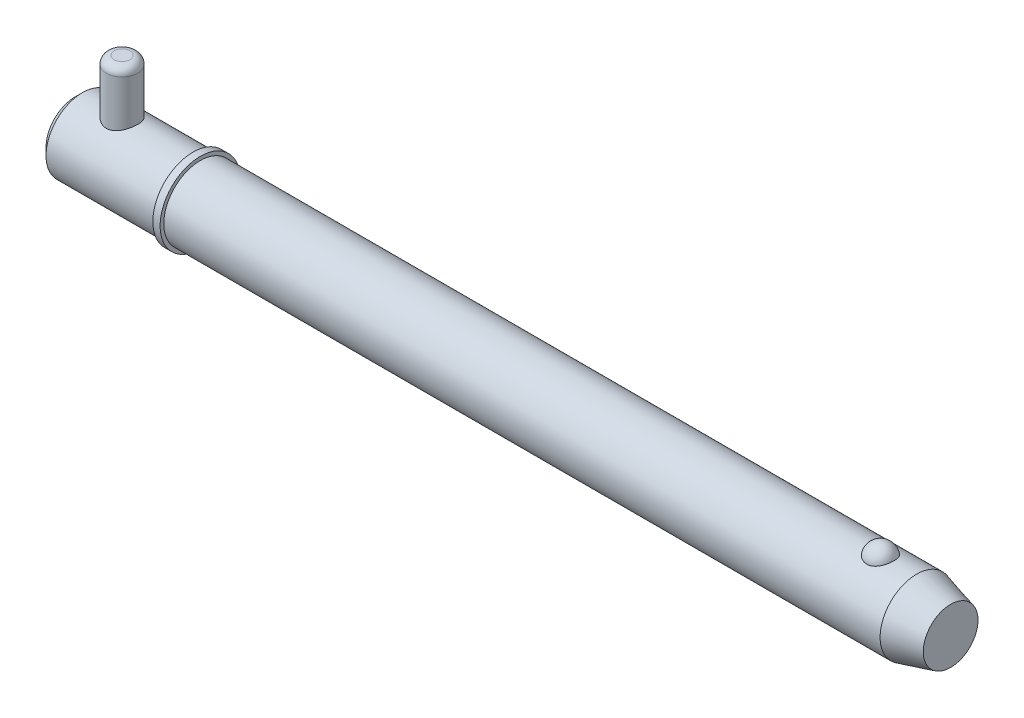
ISO-10303-21;
HEADER;
FILE_DESCRIPTION(('STEP AP214'),'2;1');
FILE_NAME('part.step','',(''),(''),'','','');
FILE_SCHEMA(('AUTOMOTIVE_DESIGN { 1 0 10303 214 1 1 1 1 }'));
ENDSEC;
DATA;
#1=APPLICATION_CONTEXT('core data for automotive mechanical design processes');
#2=APPLICATION_PROTOCOL_DEFINITION('international standard','automotive_design',2000,#1);
#3=PRODUCT_CONTEXT('',#1,'mechanical');
#4=PRODUCT('Part','Part','',(#3));
#5=PRODUCT_RELATED_PRODUCT_CATEGORY('part','',(#4));
#6=PRODUCT_DEFINITION_FORMATION('','',#4);
#7=PRODUCT_DEFINITION_CONTEXT('part definition',#1,'design');
#8=PRODUCT_DEFINITION('design','',#6,#7);
#9=PRODUCT_DEFINITION_SHAPE('','',#8);
#10=(LENGTH_UNIT() NAMED_UNIT(*) SI_UNIT(.MILLI.,.METRE.));
#11=(NAMED_UNIT(*) PLANE_ANGLE_UNIT() SI_UNIT($,.RADIAN.));
#12=(NAMED_UNIT(*) SI_UNIT($,.STERADIAN.) SOLID_ANGLE_UNIT());
#13=UNCERTAINTY_MEASURE_WITH_UNIT(LENGTH_MEASURE(1.E-05),#10,'distance_accuracy_value','');
#14=(GEOMETRIC_REPRESENTATION_CONTEXT(3) GLOBAL_UNCERTAINTY_ASSIGNED_CONTEXT((#13)) GLOBAL_UNIT_ASSIGNED_CONTEXT((#10,
#11,#12)) REPRESENTATION_CONTEXT('',''));
#15=CARTESIAN_POINT('',(0.,0.,0.));
#16=DIRECTION('',(0.,0.,1.));
#17=DIRECTION('',(1.,0.,0.));
#18=AXIS2_PLACEMENT_3D('',#15,#16,#17);
#19=CARTESIAN_POINT('',(14.28,26.985,0.));
#20=DIRECTION('',(0.,-1.,0.));
#21=DIRECTION('',(0.,0.,-1.));
#22=AXIS2_PLACEMENT_3D('',#19,#20,#21);
#23=CYLINDRICAL_SURFACE('',#22,4.76);
#24=CARTESIAN_POINT('',(14.28,-8.73500000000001,0.));
#25=DIRECTION('',(0.,1.,0.));
#26=DIRECTION('',(0.,0.,1.));
#27=AXIS2_PLACEMENT_3D('',#24,#25,#26);
#28=CIRCLE('',#27,4.76);
#29=CARTESIAN_POINT('',(14.28,-8.73500000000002,-4.76));
#30=VERTEX_POINT('',#29);
#31=EDGE_CURVE('P0_E25',#30,#30,#28,.T.);
#32=CARTESIAN_POINT('',(14.28,24.605,0.));
#33=DIRECTION('',(0.,1.,0.));
#34=DIRECTION('',(0.,0.,1.));
#35=AXIS2_PLACEMENT_3D('',#32,#33,#34);
#36=CIRCLE('',#35,4.76);
#37=CARTESIAN_POINT('',(14.28,24.605,-4.76));
#38=VERTEX_POINT('',#37);
#39=EDGE_CURVE('P0_E29',#38,#38,#36,.F.);
#40=CARTESIAN_POINT('',(14.28,-8.73500000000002,-4.76));
#41=CARTESIAN_POINT('',(14.28,-8.38770833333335,-4.76));
#42=CARTESIAN_POINT('',(14.28,-8.04041666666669,-4.76));
#43=CARTESIAN_POINT('',(14.28,-7.34583333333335,-4.76));
#44=CARTESIAN_POINT('',(14.28,-6.99854166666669,-4.76));
#45=CARTESIAN_POINT('',(14.28,-6.30395833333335,-4.76));
#46=CARTESIAN_POINT('',(14.28,-5.95666666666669,-4.76));
#47=CARTESIAN_POINT('',(14.28,-5.26208333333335,-4.76));
#48=CARTESIAN_POINT('',(14.28,-4.91479166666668,-4.76));
#49=CARTESIAN_POINT('',(14.28,-4.22020833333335,-4.76));
#50=CARTESIAN_POINT('',(14.28,-3.87291666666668,-4.76));
#51=CARTESIAN_POINT('',(14.28,-3.17833333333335,-4.76));
#52=CARTESIAN_POINT('',(14.28,-2.83104166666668,-4.76));
#53=CARTESIAN_POINT('',(14.28,-2.13645833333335,-4.76));
#54=CARTESIAN_POINT('',(14.28,-1.78916666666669,-4.76));
#55=CARTESIAN_POINT('',(14.28,-1.09458333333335,-4.76));
#56=CARTESIAN_POINT('',(14.28,-0.747291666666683,-4.76));
#57=CARTESIAN_POINT('',(14.28,-0.052708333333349,-4.76));
#58=CARTESIAN_POINT('',(14.28,0.294583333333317,-4.76));
#59=CARTESIAN_POINT('',(14.28,0.989166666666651,-4.76));
#60=CARTESIAN_POINT('',(14.28,1.33645833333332,-4.76));
#61=CARTESIAN_POINT('',(14.28,2.03104166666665,-4.76));
#62=CARTESIAN_POINT('',(14.28,2.37833333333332,-4.76));
#63=CARTESIAN_POINT('',(14.28,3.07291666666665,-4.76));
#64=CARTESIAN_POINT('',(14.28,3.42020833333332,-4.76));
#65=CARTESIAN_POINT('',(14.28,4.11479166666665,-4.76));
#66=CARTESIAN_POINT('',(14.28,4.46208333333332,-4.76));
#67=CARTESIAN_POINT('',(14.28,5.15666666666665,-4.76));
#68=CARTESIAN_POINT('',(14.28,5.50395833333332,-4.76));
#69=CARTESIAN_POINT('',(14.28,6.19854166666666,-4.76));
#70=CARTESIAN_POINT('',(14.28,6.54583333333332,-4.76));
#71=CARTESIAN_POINT('',(14.28,7.24041666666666,-4.76));
#72=CARTESIAN_POINT('',(14.28,7.58770833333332,-4.76));
#73=CARTESIAN_POINT('',(14.28,8.28229166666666,-4.76));
#74=CARTESIAN_POINT('',(14.28,8.62958333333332,-4.76));
#75=CARTESIAN_POINT('',(14.28,9.32416666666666,-4.76));
#76=CARTESIAN_POINT('',(14.28,9.67145833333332,-4.76));
#77=CARTESIAN_POINT('',(14.28,10.3660416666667,-4.76));
#78=CARTESIAN_POINT('',(14.28,10.7133333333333,-4.76));
#79=CARTESIAN_POINT('',(14.28,11.4079166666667,-4.76));
#80=CARTESIAN_POINT('',(14.28,11.7552083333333,-4.76));
#81=CARTESIAN_POINT('',(14.28,12.4497916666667,-4.76));
#82=CARTESIAN_POINT('',(14.28,12.7970833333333,-4.76));
#83=CARTESIAN_POINT('',(14.28,13.4916666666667,-4.76));
#84=CARTESIAN_POINT('',(14.28,13.8389583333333,-4.76));
#85=CARTESIAN_POINT('',(14.28,14.5335416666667,-4.76));
#86=CARTESIAN_POINT('',(14.28,14.8808333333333,-4.76));
#87=CARTESIAN_POINT('',(14.28,15.5754166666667,-4.76));
#88=CARTESIAN_POINT('',(14.28,15.9227083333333,-4.76));
#89=CARTESIAN_POINT('',(14.28,16.6172916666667,-4.76));
#90=CARTESIAN_POINT('',(14.28,16.9645833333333,-4.76));
#91=CARTESIAN_POINT('',(14.28,17.6591666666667,-4.76));
#92=CARTESIAN_POINT('',(14.28,18.0064583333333,-4.76));
#93=CARTESIAN_POINT('',(14.28,18.7010416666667,-4.76));
#94=CARTESIAN_POINT('',(14.28,19.0483333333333,-4.76));
#95=CARTESIAN_POINT('',(14.28,19.7429166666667,-4.76));
#96=CARTESIAN_POINT('',(14.28,20.0902083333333,-4.76));
#97=CARTESIAN_POINT('',(14.28,20.7847916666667,-4.76));
#98=CARTESIAN_POINT('',(14.28,21.1320833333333,-4.76));
#99=CARTESIAN_POINT('',(14.28,21.8266666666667,-4.76));
#100=CARTESIAN_POINT('',(14.28,22.1739583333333,-4.76));
#101=CARTESIAN_POINT('',(14.28,22.8685416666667,-4.76));
#102=CARTESIAN_POINT('',(14.28,23.2158333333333,-4.76));
#103=CARTESIAN_POINT('',(14.28,23.9104166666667,-4.76));
#104=CARTESIAN_POINT('',(14.28,24.2577083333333,-4.76));
#105=CARTESIAN_POINT('',(14.28,24.605,-4.76));
#106=B_SPLINE_CURVE_WITH_KNOTS('',3,(#40,#41,#42,#43,#44,#45,#46,#47,#48,#49,#50,#51,#52,#53,
#54,#55,#56,#57,#58,#59,#60,#61,#62,#63,#64,#65,#66,#67,#68,#69,#70,#71,#72,#73,#74,#75,#76,#77,
#78,#79,#80,#81,#82,#83,#84,#85,#86,#87,#88,#89,#90,#91,#92,#93,#94,#95,#96,#97,#98,#99,#100,
#101,#102,#103,#104,#105),.UNSPECIFIED.,.F.,.F.,(4,2,2,2,2,2,2,2,2,2,2,2,2,2,2,2,2,2,2,2,2,2,2,
2,2,2,2,2,2,2,2,2,4),(0.,1.041875,2.08375,3.125625,4.1675,5.209375,6.25125,7.293125,
8.33500000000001,9.376875,10.41875,11.460625,12.5025,13.544375,14.58625,15.628125,16.67,
17.711875,18.75375,19.795625,20.8375,21.879375,22.92125,23.963125,25.005,26.046875,27.08875,
28.130625,29.1725,30.214375,31.25625,32.298125,33.34),.UNSPECIFIED.);
#107=EDGE_CURVE('P0_BSEAM14',#30,#38,#106,.T.);
#108=ORIENTED_EDGE('',*,*,#31,.T.);
#109=ORIENTED_EDGE('',*,*,#39,.T.);
#110=ORIENTED_EDGE('',*,*,#107,.T.);
#111=ORIENTED_EDGE('',*,*,#107,.F.);
#112=EDGE_LOOP('',(#108,#110,#109,#111));
#113=FACE_BOUND('',#112,.T.);
#114=ADVANCED_FACE('P0_F14',(#113),#23,.T.);
#115=CARTESIAN_POINT('',(14.28,26.985,0.));
#116=DIRECTION('',(0.,1.,0.));
#117=DIRECTION('',(0.,0.,1.));
#118=AXIS2_PLACEMENT_3D('',#115,#116,#117);
#119=PLANE('',#118);
#120=CARTESIAN_POINT('',(14.28,26.985,0.));
#121=DIRECTION('',(0.,1.,0.));
#122=DIRECTION('',(0.,0.,1.));
#123=AXIS2_PLACEMENT_3D('',#120,#121,#122);
#124=CIRCLE('',#123,2.38);
#125=CARTESIAN_POINT('',(14.28,26.985,2.38));
#126=VERTEX_POINT('',#125);
#127=EDGE_CURVE('P0_E10',#126,#126,#124,.T.);
#128=ORIENTED_EDGE('',*,*,#127,.T.);
#129=EDGE_LOOP('',(#128));
#130=FACE_BOUND('',#129,.T.);
#131=ADVANCED_FACE('P0_F46',(#130),#119,.T.);
#132=CARTESIAN_POINT('',(14.28,-11.115,0.));
#133=DIRECTION('',(0.,1.,0.));
#134=DIRECTION('',(0.,0.,1.));
#135=AXIS2_PLACEMENT_3D('',#132,#133,#134);
#136=PLANE('',#135);
#137=CARTESIAN_POINT('',(14.28,-11.115,0.));
#138=DIRECTION('',(0.,1.,0.));
#139=DIRECTION('',(0.,0.,1.));
#140=AXIS2_PLACEMENT_3D('',#137,#138,#139);
#141=CIRCLE('',#140,2.38);
#142=CARTESIAN_POINT('',(14.28,-11.115,2.38));
#143=VERTEX_POINT('',#142);
#144=EDGE_CURVE('P0_E21',#143,#143,#141,.F.);
#145=ORIENTED_EDGE('',*,*,#144,.T.);
#146=EDGE_LOOP('',(#145));
#147=FACE_BOUND('',#146,.T.);
#148=ADVANCED_FACE('P0_F43',(#147),#136,.F.);
#149=CARTESIAN_POINT('',(14.28,-8.735,0.));
#150=DIRECTION('',(0.,1.,0.));
#151=DIRECTION('',(0.,0.,1.));
#152=AXIS2_PLACEMENT_3D('',#149,#150,#151);
#153=DEGENERATE_TOROIDAL_SURFACE('',#152,2.38,2.38,.T.);
#154=ORIENTED_EDGE('',*,*,#144,.F.);
#155=EDGE_LOOP('',(#154));
#156=FACE_BOUND('',#155,.T.);
#157=ORIENTED_EDGE('',*,*,#31,.F.);
#158=EDGE_LOOP('',(#157));
#159=FACE_BOUND('',#158,.T.);
#160=ADVANCED_FACE('P0_F38',(#156,#159),#153,.T.);
#161=CARTESIAN_POINT('',(14.28,24.605,0.));
#162=DIRECTION('',(0.,1.,0.));
#163=DIRECTION('',(0.,0.,1.));
#164=AXIS2_PLACEMENT_3D('',#161,#162,#163);
#165=DEGENERATE_TOROIDAL_SURFACE('',#164,2.38,2.38,.T.);
#166=ORIENTED_EDGE('',*,*,#39,.F.);
#167=EDGE_LOOP('',(#166));
#168=FACE_BOUND('',#167,.T.);
#169=ORIENTED_EDGE('',*,*,#127,.F.);
#170=EDGE_LOOP('',(#169));
#171=FACE_BOUND('',#170,.T.);
#172=ADVANCED_FACE('P0_F16',(#168,#171),#165,.T.);
#173=CLOSED_SHELL('',(#114,#131,#148,#160,#172));
#174=MANIFOLD_SOLID_BREP('P0_B1',#173);
#175=CARTESIAN_POINT('',(0.,0.,0.));
#176=DIRECTION('',(1.,0.,0.));
#177=DIRECTION('',(0.,0.,-1.));
#178=AXIS2_PLACEMENT_3D('',#175,#176,#177);
#179=CYLINDRICAL_SURFACE('',#178,11.115);
#180=CARTESIAN_POINT('',(256.329563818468,0.,0.));
#181=DIRECTION('',(1.,0.,0.));
#182=DIRECTION('',(0.,0.,-1.));
#183=AXIS2_PLACEMENT_3D('',#180,#181,#182);
#184=CIRCLE('',#183,11.115);
#185=CARTESIAN_POINT('',(256.329563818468,0.,-11.115));
#186=VERTEX_POINT('',#185);
#187=EDGE_CURVE('P1_E81',#186,#186,#184,.T.);
#188=ORIENTED_EDGE('',*,*,#187,.F.);
#189=EDGE_LOOP('',(#188));
#190=FACE_BOUND('',#189,.T.);
#191=CARTESIAN_POINT('',(38.1,0.,0.));
#192=DIRECTION('',(1.,0.,0.));
#193=DIRECTION('',(0.,0.,-1.));
#194=AXIS2_PLACEMENT_3D('',#191,#192,#193);
#195=CIRCLE('',#194,11.115);
#196=CARTESIAN_POINT('',(38.1,0.,-11.115));
#197=VERTEX_POINT('',#196);
#198=EDGE_CURVE('P1_E85',#197,#197,#195,.T.);
#199=ORIENTED_EDGE('',*,*,#198,.T.);
#200=EDGE_LOOP('',(#199));
#201=FACE_BOUND('',#200,.T.);
#202=CARTESIAN_POINT('',(245.331068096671,10.3028087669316,4.17077409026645));
#203=CARTESIAN_POINT('',(245.114775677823,10.3028003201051,4.17078240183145));
#204=CARTESIAN_POINT('',(244.898548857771,10.3098895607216,4.15340593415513));
#205=CARTESIAN_POINT('',(244.472540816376,10.3373834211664,4.08449540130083));
#206=CARTESIAN_POINT('',(244.262757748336,10.3577841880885,4.0329712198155));
#207=CARTESIAN_POINT('',(243.855782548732,10.4095237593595,3.89746513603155));
#208=CARTESIAN_POINT('',(243.658572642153,10.4408466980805,3.81353029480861));
#209=CARTESIAN_POINT('',(243.281338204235,10.5110236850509,3.61560339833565));
#210=CARTESIAN_POINT('',(243.101317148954,10.5498792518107,3.50160528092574));
#211=CARTESIAN_POINT('',(242.757684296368,10.6322884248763,3.24292464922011));
#212=CARTESIAN_POINT('',(242.594686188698,10.6759443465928,3.09746040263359));
#213=CARTESIAN_POINT('',(242.294591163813,10.7625291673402,2.7817192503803));
#214=CARTESIAN_POINT('',(242.157499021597,10.8054579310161,2.61143778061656));
#215=CARTESIAN_POINT('',(241.906408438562,10.8881935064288,2.24226695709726));
#216=CARTESIAN_POINT('',(241.793710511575,10.9277761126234,2.04244123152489));
#217=CARTESIAN_POINT('',(241.601777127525,10.997484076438,1.62578254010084));
#218=CARTESIAN_POINT('',(241.522544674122,11.0276085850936,1.40894804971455));
#219=CARTESIAN_POINT('',(241.398303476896,11.0756732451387,0.961250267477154));
#220=CARTESIAN_POINT('',(241.353760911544,11.0934470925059,0.730239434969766));
#221=CARTESIAN_POINT('',(241.301569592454,11.1143331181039,0.263439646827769));
#222=CARTESIAN_POINT('',(241.293920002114,11.1174456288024,0.027650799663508));
#223=CARTESIAN_POINT('',(241.31561056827,11.1087161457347,-0.440729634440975));
#224=CARTESIAN_POINT('',(241.344762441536,11.0969502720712,-0.673331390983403));
#225=CARTESIAN_POINT('',(241.439143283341,11.0597872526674,-1.12996621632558));
#226=CARTESIAN_POINT('',(241.504372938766,11.0343898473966,-1.35399912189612));
#227=CARTESIAN_POINT('',(241.66969844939,10.972515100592,-1.78750286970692));
#228=CARTESIAN_POINT('',(241.76983863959,10.9360236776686,-1.99695478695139));
#229=CARTESIAN_POINT('',(242.002940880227,10.8557595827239,-2.3952066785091));
#230=CARTESIAN_POINT('',(242.135905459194,10.8119863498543,-2.5840050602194));
#231=CARTESIAN_POINT('',(242.432407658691,10.7216733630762,-2.93635726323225));
#232=CARTESIAN_POINT('',(242.596056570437,10.675123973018,-3.09981510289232));
#233=CARTESIAN_POINT('',(242.949860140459,10.5846571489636,-3.39592247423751));
#234=CARTESIAN_POINT('',(243.140012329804,10.5407394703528,-3.52857487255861));
#235=CARTESIAN_POINT('',(243.53750141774,10.4616690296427,-3.75646057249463));
#236=CARTESIAN_POINT('',(243.74436705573,10.4263443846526,-3.85245432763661));
#237=CARTESIAN_POINT('',(244.172954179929,10.3675574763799,-4.00798747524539));
#238=CARTESIAN_POINT('',(244.394670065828,10.344090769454,-4.0675405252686));
#239=CARTESIAN_POINT('',(244.834669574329,10.3128282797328,-4.14614314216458));
#240=CARTESIAN_POINT('',(245.052565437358,10.3043040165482,-4.1670783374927));
#241=CARTESIAN_POINT('',(245.48894951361,10.3016771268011,-4.17357158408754));
#242=CARTESIAN_POINT('',(245.707437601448,10.3075716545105,-4.15913661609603));
#243=CARTESIAN_POINT('',(246.131744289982,10.3326686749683,-4.09636961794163));
#244=CARTESIAN_POINT('',(246.337745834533,10.3514555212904,-4.0490957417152));
#245=CARTESIAN_POINT('',(246.738576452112,10.399818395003,-3.92320197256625));
#246=CARTESIAN_POINT('',(246.9334046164,10.4293952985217,-3.84457953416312));
#247=CARTESIAN_POINT('',(247.311191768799,10.4969600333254,-3.65612410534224));
#248=CARTESIAN_POINT('',(247.493797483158,10.5351178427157,-3.54564545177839));
#249=CARTESIAN_POINT('',(247.838204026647,10.6154999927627,-3.29718036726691));
#250=CARTESIAN_POINT('',(248.000000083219,10.657725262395,-3.15918764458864));
#251=CARTESIAN_POINT('',(248.306959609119,10.744212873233,-2.85163580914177));
#252=CARTESIAN_POINT('',(248.450891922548,10.7884718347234,-2.68084605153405));
#253=CARTESIAN_POINT('',(248.709237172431,10.872374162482,-2.31721864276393));
#254=CARTESIAN_POINT('',(248.823644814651,10.9120167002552,-2.12437704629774));
#255=CARTESIAN_POINT('',(249.023873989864,10.9838919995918,-1.71516999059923));
#256=CARTESIAN_POINT('',(249.10866178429,11.0158465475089,-1.49824866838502));
#257=CARTESIAN_POINT('',(249.24268382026,11.0673523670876,-1.05228572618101));
#258=CARTESIAN_POINT('',(249.291917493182,11.086903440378,-0.823243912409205));
#259=CARTESIAN_POINT('',(249.353891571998,11.1116323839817,-0.359087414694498));
#260=CARTESIAN_POINT('',(249.366566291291,11.1167843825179,-0.123962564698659));
#261=CARTESIAN_POINT('',(249.354973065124,11.1121144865,0.345220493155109));
#262=CARTESIAN_POINT('',(249.330705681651,11.1022928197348,0.579278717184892));
#263=CARTESIAN_POINT('',(249.245907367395,11.0687504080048,1.03866534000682));
#264=CARTESIAN_POINT('',(249.185529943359,11.0450885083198,1.26402641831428));
#265=CARTESIAN_POINT('',(249.029853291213,10.9863185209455,1.70076772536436));
#266=CARTESIAN_POINT('',(248.934551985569,10.9512097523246,1.91214712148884));
#267=CARTESIAN_POINT('',(248.710397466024,10.8729733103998,2.316083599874));
#268=CARTESIAN_POINT('',(248.581380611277,10.8298068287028,2.50854240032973));
#269=CARTESIAN_POINT('',(248.292732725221,10.7401896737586,2.86808766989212));
#270=CARTESIAN_POINT('',(248.133102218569,10.6937390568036,3.03517457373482));
#271=CARTESIAN_POINT('',(247.787534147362,10.6029321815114,3.33857581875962));
#272=CARTESIAN_POINT('',(247.601708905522,10.5585680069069,3.47501541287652));
#273=CARTESIAN_POINT('',(247.207875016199,10.4769321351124,3.71390897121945));
#274=CARTESIAN_POINT('',(246.999863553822,10.439661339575,3.81635861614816));
#275=CARTESIAN_POINT('',(246.554066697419,10.3749407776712,3.98910631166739));
#276=CARTESIAN_POINT('',(246.315234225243,10.3482457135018,4.05700929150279));
#277=CARTESIAN_POINT('',(245.827925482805,10.312188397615,4.14782844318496));
#278=CARTESIAN_POINT('',(245.579453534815,10.3028184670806,4.17076454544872));
#279=CARTESIAN_POINT('',(245.331068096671,10.3028087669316,4.17077409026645));
#280=B_SPLINE_CURVE_WITH_KNOTS('',3,(#202,#203,#204,#205,#206,#207,#208,#209,#210,#211,#212,
#213,#214,#215,#216,#217,#218,#219,#220,#221,#222,#223,#224,#225,#226,#227,#228,#229,#230,#231,
#232,#233,#234,#235,#236,#237,#238,#239,#240,#241,#242,#243,#244,#245,#246,#247,#248,#249,#250,
#251,#252,#253,#254,#255,#256,#257,#258,#259,#260,#261,#262,#263,#264,#265,#266,#267,#268,#269,
#270,#271,#272,#273,#274,#275,#276,#277,#278,#279),.UNSPECIFIED.,.T.,.F.,(4,2,2,2,2,2,2,2,2,2,2,
2,2,2,2,2,2,2,2,2,2,2,2,2,2,2,2,2,2,2,2,2,2,2,2,2,2,2,4),(0.,0.64796614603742,1.29574482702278,
1.94258643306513,2.58955857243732,3.25496465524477,3.92049326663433,4.61566368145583,
5.31089647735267,6.01531821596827,6.71972398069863,7.42054043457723,8.12137023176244,
8.82309331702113,9.5248704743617,10.2292439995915,10.9335519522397,11.6223330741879,
12.3108558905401,12.9647664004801,13.6185478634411,14.252184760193,14.8858731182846,
15.5334360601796,16.1811472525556,16.8611459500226,17.5412664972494,18.2431855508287,
18.9451158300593,19.6483065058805,20.3514864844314,21.0516982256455,21.7519516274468,
22.4556690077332,23.1593743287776,23.860149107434,24.5610129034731,25.3054529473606,
26.049562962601),.UNSPECIFIED.);
#281=CARTESIAN_POINT('',(245.331068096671,10.3028087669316,4.17077409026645));
#282=VERTEX_POINT('',#281);
#283=EDGE_CURVE('P1_E35',#282,#282,#280,.T.);
#284=ORIENTED_EDGE('',*,*,#283,.T.);
#285=EDGE_LOOP('',(#284));
#286=FACE_BOUND('',#285,.T.);
#287=ADVANCED_FACE('P1_F13',(#190,#201,#286),#179,.T.);
#288=CARTESIAN_POINT('',(0.,0.,0.));
#289=DIRECTION('',(-1.,0.,0.));
#290=DIRECTION('',(0.,0.,1.));
#291=AXIS2_PLACEMENT_3D('',#288,#289,#290);
#292=PLANE('',#291);
#293=CARTESIAN_POINT('',(0.,0.,0.));
#294=DIRECTION('',(1.,0.,0.));
#295=DIRECTION('',(0.,0.,-1.));
#296=AXIS2_PLACEMENT_3D('',#293,#294,#295);
#297=CIRCLE('',#296,8.892);
#298=CARTESIAN_POINT('',(0.,0.,-8.892));
#299=VERTEX_POINT('',#298);
#300=EDGE_CURVE('P1_E9',#299,#299,#297,.T.);
#301=ORIENTED_EDGE('',*,*,#300,.F.);
#302=EDGE_LOOP('',(#301));
#303=FACE_BOUND('',#302,.T.);
#304=ADVANCED_FACE('P1_F15',(#303),#292,.T.);
#305=CARTESIAN_POINT('',(2.22299999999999,0.,0.));
#306=DIRECTION('',(1.,0.,0.));
#307=DIRECTION('',(0.,0.,-1.));
#308=AXIS2_PLACEMENT_3D('',#305,#306,#307);
#309=CONICAL_SURFACE('',#308,11.115,0.78539816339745);
#310=ORIENTED_EDGE('',*,*,#300,.T.);
#311=EDGE_LOOP('',(#310));
#312=FACE_BOUND('',#311,.T.);
#313=CARTESIAN_POINT('',(2.22299999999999,0.,0.));
#314=DIRECTION('',(1.,0.,0.));
#315=DIRECTION('',(0.,0.,-1.));
#316=AXIS2_PLACEMENT_3D('',#313,#314,#315);
#317=CIRCLE('',#316,11.115);
#318=CARTESIAN_POINT('',(2.22299999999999,0.,-11.115));
#319=VERTEX_POINT('',#318);
#320=EDGE_CURVE('P1_E26',#319,#319,#317,.T.);
#321=ORIENTED_EDGE('',*,*,#320,.F.);
#322=EDGE_LOOP('',(#321));
#323=FACE_BOUND('',#322,.T.);
#324=ADVANCED_FACE('P1_F77',(#312,#323),#309,.T.);
#325=CARTESIAN_POINT('',(0.,0.,0.));
#326=DIRECTION('',(1.,0.,0.));
#327=DIRECTION('',(0.,0.,-1.));
#328=AXIS2_PLACEMENT_3D('',#325,#326,#327);
#329=CYLINDRICAL_SURFACE('',#328,11.115);
#330=CARTESIAN_POINT('',(14.28,-10.0441836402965,4.76));
#331=CARTESIAN_POINT('',(14.1533731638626,-10.0441846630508,4.75999904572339));
#332=CARTESIAN_POINT('',(14.0267055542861,-10.0465865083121,4.75493985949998));
#333=CARTESIAN_POINT('',(13.774298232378,-10.0561141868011,4.73475585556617));
#334=CARTESIAN_POINT('',(13.6485591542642,-10.0632429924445,4.71962470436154));
#335=CARTESIAN_POINT('',(13.3987500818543,-10.0819979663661,4.67942666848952));
#336=CARTESIAN_POINT('',(13.2746840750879,-10.0936334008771,4.65433930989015));
#337=CARTESIAN_POINT('',(13.0293244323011,-10.1210146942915,4.59449317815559));
#338=CARTESIAN_POINT('',(12.9080319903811,-10.1367622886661,4.55973032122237));
#339=CARTESIAN_POINT('',(12.669614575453,-10.1717810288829,4.48106435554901));
#340=CARTESIAN_POINT('',(12.5524727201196,-10.1910352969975,4.4372048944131));
#341=CARTESIAN_POINT('',(12.3224300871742,-10.2325403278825,4.34063417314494));
#342=CARTESIAN_POINT('',(12.2095309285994,-10.2547922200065,4.28791957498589));
#343=CARTESIAN_POINT('',(11.8782785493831,-10.3250879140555,4.11715127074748));
#344=CARTESIAN_POINT('',(11.6670799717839,-10.3767168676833,3.98637638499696));
#345=CARTESIAN_POINT('',(11.2564039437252,-10.4874309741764,3.68567149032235));
#346=CARTESIAN_POINT('',(11.0583793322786,-10.5467772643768,3.51386978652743));
#347=CARTESIAN_POINT('',(10.6927724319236,-10.6641377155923,3.13969960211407));
#348=CARTESIAN_POINT('',(10.5252022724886,-10.7221513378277,2.93731900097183));
#349=CARTESIAN_POINT('',(10.2965609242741,-10.8050020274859,2.60935726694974));
#350=CARTESIAN_POINT('',(10.2227768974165,-10.8324811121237,2.49310321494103));
#351=CARTESIAN_POINT('',(10.0853380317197,-10.884703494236,2.25418999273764));
#352=CARTESIAN_POINT('',(10.0216789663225,-10.9094479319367,2.13153352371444));
#353=CARTESIAN_POINT('',(9.90506238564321,-10.9554932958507,1.88060370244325));
#354=CARTESIAN_POINT('',(9.85210574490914,-10.9767939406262,1.7523298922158));
#355=CARTESIAN_POINT('',(9.75746464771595,-11.0153112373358,1.49115740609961));
#356=CARTESIAN_POINT('',(9.71577447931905,-11.0325299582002,1.35826111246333));
#357=CARTESIAN_POINT('',(9.64605475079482,-11.0615607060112,1.09614539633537));
#358=CARTESIAN_POINT('',(9.61740732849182,-11.0736151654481,0.96711700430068));
#359=CARTESIAN_POINT('',(9.57092026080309,-11.0932687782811,0.706847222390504));
#360=CARTESIAN_POINT('',(9.55307574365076,-11.1008699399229,0.575606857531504));
#361=CARTESIAN_POINT('',(9.52838640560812,-11.1114054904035,0.31192917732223));
#362=CARTESIAN_POINT('',(9.52153986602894,-11.114340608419,0.179492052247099));
#363=CARTESIAN_POINT('',(9.51892405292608,-11.1154607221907,-0.0855090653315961));
#364=CARTESIAN_POINT('',(9.52315432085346,-11.1136459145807,-0.218073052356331));
#365=CARTESIAN_POINT('',(9.542009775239,-11.1055891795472,-0.473709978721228));
#366=CARTESIAN_POINT('',(9.55594693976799,-11.099640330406,-0.596843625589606));
#367=CARTESIAN_POINT('',(9.59332832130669,-11.0837823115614,-0.841440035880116));
#368=CARTESIAN_POINT('',(9.61677567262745,-11.0738718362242,-0.962902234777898));
#369=CARTESIAN_POINT('',(9.67294089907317,-11.0503378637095,-1.20325684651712));
#370=CARTESIAN_POINT('',(9.70565569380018,-11.0367156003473,-1.32215009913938));
#371=CARTESIAN_POINT('',(9.78005008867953,-11.0060908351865,-1.55666640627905));
#372=CARTESIAN_POINT('',(9.82173311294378,-10.9890870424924,-1.67228819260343));
#373=CARTESIAN_POINT('',(9.96110379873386,-10.9330280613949,-2.01656166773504));
#374=CARTESIAN_POINT('',(10.0722987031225,-10.8892801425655,-2.23915547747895));
#375=CARTESIAN_POINT('',(10.3268588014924,-10.7934745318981,-2.66299199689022));
#376=CARTESIAN_POINT('',(10.4702355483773,-10.7414138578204,-2.86422700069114));
#377=CARTESIAN_POINT('',(10.7973904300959,-10.6296201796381,-3.25557775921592));
#378=CARTESIAN_POINT('',(10.9833705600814,-10.569604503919,-3.443774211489));
#379=CARTESIAN_POINT('',(11.3844486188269,-10.4514707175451,-3.78722133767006));
#380=CARTESIAN_POINT('',(11.5995590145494,-10.3933534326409,-3.94245783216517));
#381=CARTESIAN_POINT('',(11.9444340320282,-10.311516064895,-4.14990014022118));
#382=CARTESIAN_POINT('',(12.0654579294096,-10.2847012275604,-4.21573894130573));
#383=CARTESIAN_POINT('',(12.3132718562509,-10.2342051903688,-4.33688518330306));
#384=CARTESIAN_POINT('',(12.4400593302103,-10.2105226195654,-4.39219723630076));
#385=CARTESIAN_POINT('',(12.6985418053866,-10.1671237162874,-4.49174500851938));
#386=CARTESIAN_POINT('',(12.8302359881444,-10.1474067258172,-4.53598256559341));
#387=CARTESIAN_POINT('',(13.0975061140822,-10.1126841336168,-4.61287629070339));
#388=CARTESIAN_POINT('',(13.233079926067,-10.0976759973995,-4.64553869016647));
#389=CARTESIAN_POINT('',(13.4978553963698,-10.0737863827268,-4.6971059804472));
#390=CARTESIAN_POINT('',(13.6268754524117,-10.0645618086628,-4.716785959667));
#391=CARTESIAN_POINT('',(13.8862990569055,-10.051062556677,-4.74548419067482));
#392=CARTESIAN_POINT('',(14.0167019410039,-10.0467856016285,-4.75450734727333));
#393=CARTESIAN_POINT('',(14.277859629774,-10.0433352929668,-4.76179143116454));
#394=CARTESIAN_POINT('',(14.4086143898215,-10.0441613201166,-4.76005366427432));
#395=CARTESIAN_POINT('',(14.6694025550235,-10.0508838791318,-4.74584231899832));
#396=CARTESIAN_POINT('',(14.7994359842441,-10.0567802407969,-4.73336910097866));
#397=CARTESIAN_POINT('',(15.0487369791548,-10.0728449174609,-4.69907984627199));
#398=CARTESIAN_POINT('',(15.1681238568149,-10.0826872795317,-4.67797462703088));
#399=CARTESIAN_POINT('',(15.4045894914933,-10.1062580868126,-4.62682977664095));
#400=CARTESIAN_POINT('',(15.5216674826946,-10.1199877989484,-4.59678723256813));
#401=CARTESIAN_POINT('',(15.868278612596,-10.1664161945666,-4.49365911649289));
#402=CARTESIAN_POINT('',(16.0933756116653,-10.2043671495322,-4.40754694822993));
#403=CARTESIAN_POINT('',(16.5357981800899,-10.2919879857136,-4.19898201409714));
#404=CARTESIAN_POINT('',(16.7523611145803,-10.3420954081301,-4.07511281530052));
#405=CARTESIAN_POINT('',(17.1627188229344,-10.4477911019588,-3.7959429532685));
#406=CARTESIAN_POINT('',(17.3565033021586,-10.5033818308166,-3.64062816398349));
#407=CARTESIAN_POINT('',(17.7334034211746,-10.6196376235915,-3.28693729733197));
#408=CARTESIAN_POINT('',(17.9141276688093,-10.6803237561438,-3.08599175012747));
#409=CARTESIAN_POINT('',(18.1582189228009,-10.7666348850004,-2.76320365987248));
#410=CARTESIAN_POINT('',(18.2351223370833,-10.7946346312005,-2.65197124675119));
#411=CARTESIAN_POINT('',(18.3793967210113,-10.8483267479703,-2.42297927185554));
#412=CARTESIAN_POINT('',(18.4467718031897,-10.87402011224,-2.30522255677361));
#413=CARTESIAN_POINT('',(18.5717669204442,-10.9225249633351,-2.06324665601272));
#414=CARTESIAN_POINT('',(18.6293326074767,-10.9453202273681,-1.93899615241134));
#415=CARTESIAN_POINT('',(18.73370006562,-10.9872100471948,-1.6855059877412));
#416=CARTESIAN_POINT('',(18.7805065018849,-11.0063062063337,-1.55626851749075));
#417=CARTESIAN_POINT('',(18.8628731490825,-11.0402419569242,-1.29375150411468));
#418=CARTESIAN_POINT('',(18.8984366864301,-11.0550828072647,-1.16047316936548));
#419=CARTESIAN_POINT('',(18.9579183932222,-11.0800638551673,-0.890912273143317));
#420=CARTESIAN_POINT('',(18.9818374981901,-11.0902044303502,-0.75462995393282));
#421=CARTESIAN_POINT('',(19.0164177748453,-11.104911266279,-0.490295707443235));
#422=CARTESIAN_POINT('',(19.027922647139,-11.1098318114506,-0.362373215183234));
#423=CARTESIAN_POINT('',(19.040554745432,-11.1152360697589,-0.105876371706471));
#424=CARTESIAN_POINT('',(19.0416784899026,-11.1157182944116,0.0226981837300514));
#425=CARTESIAN_POINT('',(19.0335275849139,-11.1122291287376,0.27938352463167));
#426=CARTESIAN_POINT('',(19.0242587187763,-11.1082602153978,0.407494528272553));
#427=CARTESIAN_POINT('',(18.9954320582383,-11.0959792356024,0.662388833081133));
#428=CARTESIAN_POINT('',(18.9758704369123,-11.0876655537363,0.789171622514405));
#429=CARTESIAN_POINT('',(18.9276379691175,-11.0673259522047,1.03545890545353));
#430=CARTESIAN_POINT('',(18.8993573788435,-11.0554596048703,1.15505309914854));
#431=CARTESIAN_POINT('',(18.8337694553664,-11.0282166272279,1.39134516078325));
#432=CARTESIAN_POINT('',(18.7964589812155,-11.0128387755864,1.5080420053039));
#433=CARTESIAN_POINT('',(18.671464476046,-10.9619666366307,1.85262797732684));
#434=CARTESIAN_POINT('',(18.5706772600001,-10.9217161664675,2.07521484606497));
#435=CARTESIAN_POINT('',(18.33202463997,-10.8301378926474,2.51061719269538));
#436=CARTESIAN_POINT('',(18.1926775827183,-10.7783885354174,2.72252375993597));
#437=CARTESIAN_POINT('',(17.8829747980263,-10.669863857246,3.12088015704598));
#438=CARTESIAN_POINT('',(17.7126068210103,-10.6130865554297,3.30731987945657));
#439=CARTESIAN_POINT('',(17.3310036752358,-10.495668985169,3.66358491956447));
#440=CARTESIAN_POINT('',(17.1177010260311,-10.4350471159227,3.83122543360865));
#441=CARTESIAN_POINT('',(16.7778915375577,-10.3495418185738,4.05420569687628));
#442=CARTESIAN_POINT('',(16.6612023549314,-10.3219229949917,4.12383380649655));
#443=CARTESIAN_POINT('',(16.4218466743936,-10.2693487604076,4.25306463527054));
#444=CARTESIAN_POINT('',(16.2991829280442,-10.2443921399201,4.31267191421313));
#445=CARTESIAN_POINT('',(16.0488008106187,-10.1979981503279,4.42126071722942));
#446=CARTESIAN_POINT('',(15.9210894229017,-10.1765561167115,4.47025635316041));
#447=CARTESIAN_POINT('',(15.6613937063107,-10.1379191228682,4.55720152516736));
#448=CARTESIAN_POINT('',(15.5294115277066,-10.1207220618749,4.59515652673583));
#449=CARTESIAN_POINT('',(15.2624981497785,-10.091252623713,4.65951684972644));
#450=CARTESIAN_POINT('',(15.1275757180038,-10.0789672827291,4.68595259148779));
#451=CARTESIAN_POINT('',(14.8556442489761,-10.0597530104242,4.72706206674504));
#452=CARTESIAN_POINT('',(14.7186368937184,-10.0528199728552,4.74174481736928));
#453=CARTESIAN_POINT('',(14.5310955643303,-10.047196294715,4.75363843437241));
#454=CARTESIAN_POINT('',(14.48091543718,-10.0460674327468,4.75602323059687));
#455=CARTESIAN_POINT('',(14.3804923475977,-10.044560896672,4.7592042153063));
#456=CARTESIAN_POINT('',(14.3302493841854,-10.0441832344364,4.76000037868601));
#457=CARTESIAN_POINT('',(14.28,-10.0441836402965,4.76));
#458=B_SPLINE_CURVE_WITH_KNOTS('',3,(#330,#331,#332,#333,#334,#335,#336,#337,#338,#339,#340,
#341,#342,#343,#344,#345,#346,#347,#348,#349,#350,#351,#352,#353,#354,#355,#356,#357,#358,#359,
#360,#361,#362,#363,#364,#365,#366,#367,#368,#369,#370,#371,#372,#373,#374,#375,#376,#377,#378,
#379,#380,#381,#382,#383,#384,#385,#386,#387,#388,#389,#390,#391,#392,#393,#394,#395,#396,#397,
#398,#399,#400,#401,#402,#403,#404,#405,#406,#407,#408,#409,#410,#411,#412,#413,#414,#415,#416,
#417,#418,#419,#420,#421,#422,#423,#424,#425,#426,#427,#428,#429,#430,#431,#432,#433,#434,#435,
#436,#437,#438,#439,#440,#441,#442,#443,#444,#445,#446,#447,#448,#449,#450,#451,#452,#453,#454,
#455,#456,#457),.UNSPECIFIED.,.T.,.F.,(4,2,2,2,2,2,2,2,2,2,2,2,2,2,2,2,2,2,2,2,2,2,2,2,2,2,2,2,
2,2,2,2,2,2,2,2,2,2,2,2,2,2,2,2,2,2,2,2,2,2,2,2,2,2,2,2,2,2,2,2,2,2,2,4),(0.,0.379828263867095,
0.759895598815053,1.14074858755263,1.52176256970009,1.90098898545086,2.28035867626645,
3.03818035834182,3.84125131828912,4.6446414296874,5.06541657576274,5.48601561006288,
5.90664899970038,6.3270687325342,6.72470503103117,7.12216187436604,7.51955659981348,
7.91693487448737,8.28868404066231,8.66055582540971,9.03230414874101,9.40419465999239,
10.1585834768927,10.9132435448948,11.7236471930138,12.5343987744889,12.9550196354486,
13.3754557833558,13.7958221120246,14.2159617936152,14.6079540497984,14.9997658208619,
15.3915300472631,15.7832811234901,16.1477615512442,16.512360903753,17.240999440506,
18.0012974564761,18.761937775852,19.5886929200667,20.0025782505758,20.4162843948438,
20.832212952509,21.2479608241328,21.6635855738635,22.0791769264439,22.4642880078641,
22.8495282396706,23.2345541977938,23.6197234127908,23.9896813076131,24.3597680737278,
25.099327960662,25.8726239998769,26.6462260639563,27.4759193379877,27.8914891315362,
28.3068693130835,28.7216936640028,29.1363123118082,29.5498292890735,29.9630287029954,
30.113753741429,30.2644811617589),.UNSPECIFIED.);
#459=CARTESIAN_POINT('',(14.28,-10.0441836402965,4.76));
#460=VERTEX_POINT('',#459);
#461=EDGE_CURVE('P1_E17',#460,#460,#458,.T.);
#462=ORIENTED_EDGE('',*,*,#461,.F.);
#463=EDGE_LOOP('',(#462));
#464=FACE_BOUND('',#463,.T.);
#465=CARTESIAN_POINT('',(14.28,10.0441836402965,4.76));
#466=CARTESIAN_POINT('',(14.4066268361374,10.0441846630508,4.75999904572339));
#467=CARTESIAN_POINT('',(14.5332944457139,10.0465865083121,4.75493985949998));
#468=CARTESIAN_POINT('',(14.785701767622,10.0561141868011,4.73475585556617));
#469=CARTESIAN_POINT('',(14.9114408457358,10.0632429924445,4.71962470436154));
#470=CARTESIAN_POINT('',(15.1612499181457,10.0819979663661,4.67942666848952));
#471=CARTESIAN_POINT('',(15.2853159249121,10.0936334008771,4.65433930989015));
#472=CARTESIAN_POINT('',(15.5306755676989,10.1210146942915,4.59449317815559));
#473=CARTESIAN_POINT('',(15.6519680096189,10.1367622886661,4.55973032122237));
#474=CARTESIAN_POINT('',(15.890385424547,10.1717810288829,4.48106435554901));
#475=CARTESIAN_POINT('',(16.0075272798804,10.1910352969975,4.4372048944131));
#476=CARTESIAN_POINT('',(16.2375699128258,10.2325403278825,4.34063417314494));
#477=CARTESIAN_POINT('',(16.3504690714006,10.2547922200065,4.28791957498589));
#478=CARTESIAN_POINT('',(16.6817214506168,10.3250879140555,4.11715127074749));
#479=CARTESIAN_POINT('',(16.8929200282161,10.3767168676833,3.98637638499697));
#480=CARTESIAN_POINT('',(17.3035960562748,10.4874309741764,3.68567149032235));
#481=CARTESIAN_POINT('',(17.5016206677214,10.5467772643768,3.51386978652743));
#482=CARTESIAN_POINT('',(17.8672275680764,10.6641377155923,3.13969960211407));
#483=CARTESIAN_POINT('',(18.0347977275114,10.7221513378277,2.93731900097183));
#484=CARTESIAN_POINT('',(18.2634390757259,10.8050020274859,2.60935726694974));
#485=CARTESIAN_POINT('',(18.3372231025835,10.8324811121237,2.49310321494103));
#486=CARTESIAN_POINT('',(18.4746619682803,10.884703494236,2.25418999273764));
#487=CARTESIAN_POINT('',(18.5383210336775,10.9094479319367,2.13153352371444));
#488=CARTESIAN_POINT('',(18.6549376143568,10.9554932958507,1.88060370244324));
#489=CARTESIAN_POINT('',(18.7078942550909,10.9767939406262,1.75232989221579));
#490=CARTESIAN_POINT('',(18.8025353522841,11.0153112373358,1.4911574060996));
#491=CARTESIAN_POINT('',(18.844225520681,11.0325299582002,1.35826111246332));
#492=CARTESIAN_POINT('',(18.9139452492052,11.0615607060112,1.09614539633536));
#493=CARTESIAN_POINT('',(18.9425926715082,11.0736151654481,0.967117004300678));
#494=CARTESIAN_POINT('',(18.9890797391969,11.0932687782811,0.706847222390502));
#495=CARTESIAN_POINT('',(19.0069242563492,11.1008699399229,0.575606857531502));
#496=CARTESIAN_POINT('',(19.0316135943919,11.1114054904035,0.311929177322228));
#497=CARTESIAN_POINT('',(19.0384601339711,11.114340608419,0.179492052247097));
#498=CARTESIAN_POINT('',(19.0410759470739,11.1154607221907,-0.0855090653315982));
#499=CARTESIAN_POINT('',(19.0368456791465,11.1136459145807,-0.218073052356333));
#500=CARTESIAN_POINT('',(19.017990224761,11.1055891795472,-0.47370997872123));
#501=CARTESIAN_POINT('',(19.004053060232,11.099640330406,-0.596843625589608));
#502=CARTESIAN_POINT('',(18.9666716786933,11.0837823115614,-0.841440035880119));
#503=CARTESIAN_POINT('',(18.9432243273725,11.0738718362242,-0.9629022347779));
#504=CARTESIAN_POINT('',(18.8870591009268,11.0503378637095,-1.20325684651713));
#505=CARTESIAN_POINT('',(18.8543443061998,11.0367156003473,-1.32215009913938));
#506=CARTESIAN_POINT('',(18.7799499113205,11.0060908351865,-1.55666640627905));
#507=CARTESIAN_POINT('',(18.7382668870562,10.9890870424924,-1.67228819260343));
#508=CARTESIAN_POINT('',(18.5988962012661,10.9330280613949,-2.01656166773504));
#509=CARTESIAN_POINT('',(18.4877012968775,10.8892801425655,-2.23915547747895));
#510=CARTESIAN_POINT('',(18.2331411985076,10.7934745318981,-2.66299199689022));
#511=CARTESIAN_POINT('',(18.0897644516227,10.7414138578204,-2.86422700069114));
#512=CARTESIAN_POINT('',(17.7626095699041,10.6296201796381,-3.25557775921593));
#513=CARTESIAN_POINT('',(17.5766294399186,10.569604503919,-3.443774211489));
#514=CARTESIAN_POINT('',(17.1755513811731,10.4514707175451,-3.78722133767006));
#515=CARTESIAN_POINT('',(16.9604409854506,10.3933534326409,-3.94245783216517));
#516=CARTESIAN_POINT('',(16.6155659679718,10.311516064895,-4.14990014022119));
#517=CARTESIAN_POINT('',(16.4945420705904,10.2847012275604,-4.21573894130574));
#518=CARTESIAN_POINT('',(16.2467281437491,10.2342051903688,-4.33688518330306));
#519=CARTESIAN_POINT('',(16.1199406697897,10.2105226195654,-4.39219723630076));
#520=CARTESIAN_POINT('',(15.8614581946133,10.1671237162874,-4.49174500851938));
#521=CARTESIAN_POINT('',(15.7297640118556,10.1474067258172,-4.53598256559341));
#522=CARTESIAN_POINT('',(15.4624938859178,10.1126841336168,-4.61287629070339));
#523=CARTESIAN_POINT('',(15.326920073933,10.0976759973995,-4.64553869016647));
#524=CARTESIAN_POINT('',(15.0621446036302,10.0737863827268,-4.6971059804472));
#525=CARTESIAN_POINT('',(14.9331245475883,10.0645618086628,-4.716785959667));
#526=CARTESIAN_POINT('',(14.6737009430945,10.051062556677,-4.74548419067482));
#527=CARTESIAN_POINT('',(14.543298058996,10.0467856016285,-4.75450734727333));
#528=CARTESIAN_POINT('',(14.2821403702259,10.0433352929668,-4.76179143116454));
#529=CARTESIAN_POINT('',(14.1513856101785,10.0441613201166,-4.76005366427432));
#530=CARTESIAN_POINT('',(13.8905974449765,10.0508838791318,-4.74584231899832));
#531=CARTESIAN_POINT('',(13.7605640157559,10.0567802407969,-4.73336910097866));
#532=CARTESIAN_POINT('',(13.5112630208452,10.0728449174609,-4.69907984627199));
#533=CARTESIAN_POINT('',(13.3918761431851,10.0826872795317,-4.67797462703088));
#534=CARTESIAN_POINT('',(13.1554105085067,10.1062580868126,-4.62682977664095));
#535=CARTESIAN_POINT('',(13.0383325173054,10.1199877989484,-4.59678723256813));
#536=CARTESIAN_POINT('',(12.691721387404,10.1664161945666,-4.49365911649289));
#537=CARTESIAN_POINT('',(12.4666243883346,10.2043671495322,-4.40754694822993));
#538=CARTESIAN_POINT('',(12.0242018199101,10.2919879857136,-4.19898201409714));
#539=CARTESIAN_POINT('',(11.8076388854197,10.3420954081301,-4.07511281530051));
#540=CARTESIAN_POINT('',(11.3972811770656,10.4477911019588,-3.7959429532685));
#541=CARTESIAN_POINT('',(11.2034966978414,10.5033818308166,-3.64062816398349));
#542=CARTESIAN_POINT('',(10.8265965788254,10.6196376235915,-3.28693729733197));
#543=CARTESIAN_POINT('',(10.6458723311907,10.6803237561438,-3.08599175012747));
#544=CARTESIAN_POINT('',(10.4017810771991,10.7666348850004,-2.76320365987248));
#545=CARTESIAN_POINT('',(10.3248776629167,10.7946346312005,-2.65197124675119));
#546=CARTESIAN_POINT('',(10.1806032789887,10.8483267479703,-2.42297927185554));
#547=CARTESIAN_POINT('',(10.1132281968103,10.87402011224,-2.30522255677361));
#548=CARTESIAN_POINT('',(9.98823307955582,10.9225249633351,-2.06324665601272));
#549=CARTESIAN_POINT('',(9.93066739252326,10.9453202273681,-1.93899615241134));
#550=CARTESIAN_POINT('',(9.82629993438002,10.9872100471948,-1.6855059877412));
#551=CARTESIAN_POINT('',(9.77949349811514,11.0063062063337,-1.55626851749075));
#552=CARTESIAN_POINT('',(9.69712685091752,11.0402419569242,-1.29375150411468));
#553=CARTESIAN_POINT('',(9.66156331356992,11.0550828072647,-1.16047316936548));
#554=CARTESIAN_POINT('',(9.60208160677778,11.0800638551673,-0.890912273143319));
#555=CARTESIAN_POINT('',(9.57816250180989,11.0902044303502,-0.754629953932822));
#556=CARTESIAN_POINT('',(9.54358222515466,11.104911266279,-0.490295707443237));
#557=CARTESIAN_POINT('',(9.53207735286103,11.1098318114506,-0.362373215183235));
#558=CARTESIAN_POINT('',(9.51944525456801,11.1152360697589,-0.105876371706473));
#559=CARTESIAN_POINT('',(9.51832151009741,11.1157182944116,0.0226981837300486));
#560=CARTESIAN_POINT('',(9.52647241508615,11.1122291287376,0.279383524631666));
#561=CARTESIAN_POINT('',(9.53574128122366,11.1082602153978,0.407494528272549));
#562=CARTESIAN_POINT('',(9.5645679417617,11.0959792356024,0.662388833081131));
#563=CARTESIAN_POINT('',(9.58412956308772,11.0876655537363,0.789171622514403));
#564=CARTESIAN_POINT('',(9.63236203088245,11.0673259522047,1.03545890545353));
#565=CARTESIAN_POINT('',(9.66064262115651,11.0554596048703,1.15505309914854));
#566=CARTESIAN_POINT('',(9.72623054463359,11.0282166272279,1.39134516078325));
#567=CARTESIAN_POINT('',(9.76354101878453,11.0128387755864,1.5080420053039));
#568=CARTESIAN_POINT('',(9.88853552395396,10.9619666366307,1.85262797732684));
#569=CARTESIAN_POINT('',(9.98932273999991,10.9217161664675,2.07521484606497));
#570=CARTESIAN_POINT('',(10.22797536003,10.8301378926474,2.51061719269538));
#571=CARTESIAN_POINT('',(10.3673224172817,10.7783885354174,2.72252375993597));
#572=CARTESIAN_POINT('',(10.6770252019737,10.669863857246,3.12088015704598));
#573=CARTESIAN_POINT('',(10.8473931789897,10.6130865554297,3.30731987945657));
#574=CARTESIAN_POINT('',(11.2289963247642,10.495668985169,3.66358491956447));
#575=CARTESIAN_POINT('',(11.4422989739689,10.4350471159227,3.83122543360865));
#576=CARTESIAN_POINT('',(11.7821084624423,10.3495418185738,4.05420569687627));
#577=CARTESIAN_POINT('',(11.8987976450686,10.3219229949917,4.12383380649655));
#578=CARTESIAN_POINT('',(12.1381533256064,10.2693487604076,4.25306463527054));
#579=CARTESIAN_POINT('',(12.2608170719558,10.2443921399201,4.31267191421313));
#580=CARTESIAN_POINT('',(12.5111991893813,10.1979981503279,4.42126071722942));
#581=CARTESIAN_POINT('',(12.6389105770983,10.1765561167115,4.47025635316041));
#582=CARTESIAN_POINT('',(12.8986062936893,10.1379191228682,4.55720152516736));
#583=CARTESIAN_POINT('',(13.0305884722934,10.1207220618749,4.59515652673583));
#584=CARTESIAN_POINT('',(13.2975018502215,10.091252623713,4.65951684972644));
#585=CARTESIAN_POINT('',(13.4324242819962,10.0789672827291,4.68595259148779));
#586=CARTESIAN_POINT('',(13.7043557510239,10.0597530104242,4.72706206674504));
#587=CARTESIAN_POINT('',(13.8413631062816,10.0528199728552,4.74174481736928));
#588=CARTESIAN_POINT('',(14.0289044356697,10.047196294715,4.75363843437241));
#589=CARTESIAN_POINT('',(14.07908456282,10.0460674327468,4.75602323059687));
#590=CARTESIAN_POINT('',(14.1795076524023,10.044560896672,4.7592042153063));
#591=CARTESIAN_POINT('',(14.2297506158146,10.0441832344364,4.76000037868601));
#592=CARTESIAN_POINT('',(14.28,10.0441836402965,4.76));
#593=B_SPLINE_CURVE_WITH_KNOTS('',3,(#465,#466,#467,#468,#469,#470,#471,#472,#473,#474,#475,
#476,#477,#478,#479,#480,#481,#482,#483,#484,#485,#486,#487,#488,#489,#490,#491,#492,#493,#494,
#495,#496,#497,#498,#499,#500,#501,#502,#503,#504,#505,#506,#507,#508,#509,#510,#511,#512,#513,
#514,#515,#516,#517,#518,#519,#520,#521,#522,#523,#524,#525,#526,#527,#528,#529,#530,#531,#532,
#533,#534,#535,#536,#537,#538,#539,#540,#541,#542,#543,#544,#545,#546,#547,#548,#549,#550,#551,
#552,#553,#554,#555,#556,#557,#558,#559,#560,#561,#562,#563,#564,#565,#566,#567,#568,#569,#570,
#571,#572,#573,#574,#575,#576,#577,#578,#579,#580,#581,#582,#583,#584,#585,#586,#587,#588,#589,
#590,#591,#592),.UNSPECIFIED.,.T.,.F.,(4,2,2,2,2,2,2,2,2,2,2,2,2,2,2,2,2,2,2,2,2,2,2,2,2,2,2,2,
2,2,2,2,2,2,2,2,2,2,2,2,2,2,2,2,2,2,2,2,2,2,2,2,2,2,2,2,2,2,2,2,2,2,2,4),(0.,0.379828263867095,
0.759895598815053,1.14074858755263,1.52176256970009,1.90098898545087,2.28035867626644,
3.03818035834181,3.84125131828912,4.6446414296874,5.06541657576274,5.48601561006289,
5.90664899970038,6.3270687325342,6.72470503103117,7.12216187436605,7.51955659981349,
7.91693487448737,8.28868404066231,8.66055582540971,9.03230414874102,9.4041946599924,
10.1585834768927,10.9132435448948,11.7236471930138,12.5343987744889,12.9550196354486,
13.3754557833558,13.7958221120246,14.2159617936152,14.6079540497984,14.9997658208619,
15.3915300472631,15.7832811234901,16.1477615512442,16.512360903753,17.240999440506,
18.0012974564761,18.761937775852,19.5886929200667,20.0025782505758,20.4162843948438,
20.832212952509,21.2479608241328,21.6635855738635,22.0791769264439,22.4642880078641,
22.8495282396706,23.2345541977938,23.6197234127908,23.9896813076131,24.3597680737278,
25.099327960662,25.8726239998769,26.6462260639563,27.4759193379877,27.8914891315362,
28.3068693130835,28.7216936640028,29.1363123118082,29.5498292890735,29.9630287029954,
30.113753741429,30.2644811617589),.UNSPECIFIED.);
#594=CARTESIAN_POINT('',(14.28,10.0441836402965,4.76));
#595=VERTEX_POINT('',#594);
#596=EDGE_CURVE('P1_E43',#595,#595,#593,.T.);
#597=ORIENTED_EDGE('',*,*,#596,.F.);
#598=EDGE_LOOP('',(#597));
#599=FACE_BOUND('',#598,.T.);
#600=ORIENTED_EDGE('',*,*,#320,.T.);
#601=EDGE_LOOP('',(#600));
#602=FACE_BOUND('',#601,.T.);
#603=CARTESIAN_POINT('',(35.877,0.,0.));
#604=DIRECTION('',(1.,0.,0.));
#605=DIRECTION('',(0.,0.,-1.));
#606=AXIS2_PLACEMENT_3D('',#603,#604,#605);
#607=CIRCLE('',#606,11.115);
#608=CARTESIAN_POINT('',(35.877,0.,-11.115));
#609=VERTEX_POINT('',#608);
#610=EDGE_CURVE('P1_E31',#609,#609,#607,.T.);
#611=ORIENTED_EDGE('',*,*,#610,.F.);
#612=EDGE_LOOP('',(#611));
#613=FACE_BOUND('',#612,.T.);
#614=ADVANCED_FACE('P1_F103',(#464,#599,#602,#613),#329,.T.);
#615=CARTESIAN_POINT('',(35.877,11.115,0.));
#616=DIRECTION('',(-1.,0.,0.));
#617=DIRECTION('',(0.,0.,1.));
#618=AXIS2_PLACEMENT_3D('',#615,#616,#617);
#619=PLANE('',#618);
#620=ORIENTED_EDGE('',*,*,#610,.T.);
#621=EDGE_LOOP('',(#620));
#622=FACE_BOUND('',#621,.T.);
#623=CARTESIAN_POINT('',(35.877,0.,0.));
#624=DIRECTION('',(1.,0.,0.));
#625=DIRECTION('',(0.,0.,-1.));
#626=AXIS2_PLACEMENT_3D('',#623,#624,#625);
#627=CIRCLE('',#626,12.2265);
#628=CARTESIAN_POINT('',(35.877,0.,-12.2265));
#629=VERTEX_POINT('',#628);
#630=EDGE_CURVE('P1_E91',#629,#629,#627,.T.);
#631=ORIENTED_EDGE('',*,*,#630,.F.);
#632=EDGE_LOOP('',(#631));
#633=FACE_BOUND('',#632,.T.);
#634=ADVANCED_FACE('P1_F100',(#622,#633),#619,.T.);
#635=CARTESIAN_POINT('',(0.,0.,0.));
#636=DIRECTION('',(1.,0.,0.));
#637=DIRECTION('',(0.,0.,-1.));
#638=AXIS2_PLACEMENT_3D('',#635,#636,#637);
#639=CYLINDRICAL_SURFACE('',#638,12.2265);
#640=ORIENTED_EDGE('',*,*,#630,.T.);
#641=EDGE_LOOP('',(#640));
#642=FACE_BOUND('',#641,.T.);
#643=CARTESIAN_POINT('',(38.1,0.,0.));
#644=DIRECTION('',(1.,0.,0.));
#645=DIRECTION('',(0.,0.,-1.));
#646=AXIS2_PLACEMENT_3D('',#643,#644,#645);
#647=CIRCLE('',#646,12.2265);
#648=CARTESIAN_POINT('',(38.1,0.,-12.2265));
#649=VERTEX_POINT('',#648);
#650=EDGE_CURVE('P1_E88',#649,#649,#647,.T.);
#651=ORIENTED_EDGE('',*,*,#650,.F.);
#652=EDGE_LOOP('',(#651));
#653=FACE_BOUND('',#652,.T.);
#654=ADVANCED_FACE('P1_F68',(#642,#653),#639,.T.);
#655=CARTESIAN_POINT('',(38.1,12.2265,0.));
#656=DIRECTION('',(1.,0.,0.));
#657=DIRECTION('',(0.,0.,-1.));
#658=AXIS2_PLACEMENT_3D('',#655,#656,#657);
#659=PLANE('',#658);
#660=ORIENTED_EDGE('',*,*,#650,.T.);
#661=EDGE_LOOP('',(#660));
#662=FACE_BOUND('',#661,.T.);
#663=ORIENTED_EDGE('',*,*,#198,.F.);
#664=EDGE_LOOP('',(#663));
#665=FACE_BOUND('',#664,.T.);
#666=ADVANCED_FACE('P1_F62',(#662,#665),#659,.T.);
#667=CARTESIAN_POINT('',(266.7,0.,0.));
#668=DIRECTION('',(-1.,0.,0.));
#669=DIRECTION('',(0.,0.,1.));
#670=AXIS2_PLACEMENT_3D('',#667,#668,#669);
#671=CONICAL_SURFACE('',#670,8.33625000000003,0.261799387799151);
#672=ORIENTED_EDGE('',*,*,#187,.T.);
#673=EDGE_LOOP('',(#672));
#674=FACE_BOUND('',#673,.T.);
#675=CARTESIAN_POINT('',(266.7,0.,0.));
#676=DIRECTION('',(1.,0.,0.));
#677=DIRECTION('',(0.,0.,-1.));
#678=AXIS2_PLACEMENT_3D('',#675,#676,#677);
#679=CIRCLE('',#678,8.33625000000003);
#680=CARTESIAN_POINT('',(266.7,0.,-8.33625000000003));
#681=VERTEX_POINT('',#680);
#682=EDGE_CURVE('P1_E42',#681,#681,#679,.T.);
#683=ORIENTED_EDGE('',*,*,#682,.F.);
#684=EDGE_LOOP('',(#683));
#685=FACE_BOUND('',#684,.T.);
#686=ADVANCED_FACE('P1_F59',(#674,#685),#671,.T.);
#687=CARTESIAN_POINT('',(266.7,8.33625000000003,0.));
#688=DIRECTION('',(1.,0.,0.));
#689=DIRECTION('',(0.,0.,-1.));
#690=AXIS2_PLACEMENT_3D('',#687,#688,#689);
#691=PLANE('',#690);
#692=ORIENTED_EDGE('',*,*,#682,.T.);
#693=EDGE_LOOP('',(#692));
#694=FACE_BOUND('',#693,.T.);
#695=ADVANCED_FACE('P1_F55',(#694),#691,.T.);
#696=CARTESIAN_POINT('',(245.331068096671,10.0035,0.));
#697=DIRECTION('',(-1.,0.,0.));
#698=DIRECTION('',(0.,1.,0.));
#699=AXIS2_PLACEMENT_3D('',#696,#697,#698);
#700=SPHERICAL_SURFACE('',#699,4.18150000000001);
#701=ORIENTED_EDGE('',*,*,#283,.F.);
#702=EDGE_LOOP('',(#701));
#703=FACE_BOUND('',#702,.T.);
#704=ADVANCED_FACE('P1_F50',(#703),#700,.T.);
#705=CARTESIAN_POINT('',(14.28,-12.2265,0.));
#706=DIRECTION('',(0.,1.,0.));
#707=DIRECTION('',(0.,0.,1.));
#708=AXIS2_PLACEMENT_3D('',#705,#706,#707);
#709=CYLINDRICAL_SURFACE('',#708,4.76);
#710=ORIENTED_EDGE('',*,*,#461,.T.);
#711=EDGE_LOOP('',(#710));
#712=FACE_BOUND('',#711,.T.);
#713=ORIENTED_EDGE('',*,*,#596,.T.);
#714=EDGE_LOOP('',(#713));
#715=FACE_BOUND('',#714,.T.);
#716=ADVANCED_FACE('P1_F54',(#712,#715),#709,.F.);
#717=CLOSED_SHELL('',(#287,#304,#324,#614,#634,#654,#666,#686,#695,#704,#716));
#718=MANIFOLD_SOLID_BREP('P1_B1',#717);
#719=ADVANCED_BREP_SHAPE_REPRESENTATION('',(#18,#174,#718),#14);
#720=SHAPE_DEFINITION_REPRESENTATION(#9,#719);
ENDSEC;
END-ISO-10303-21;
